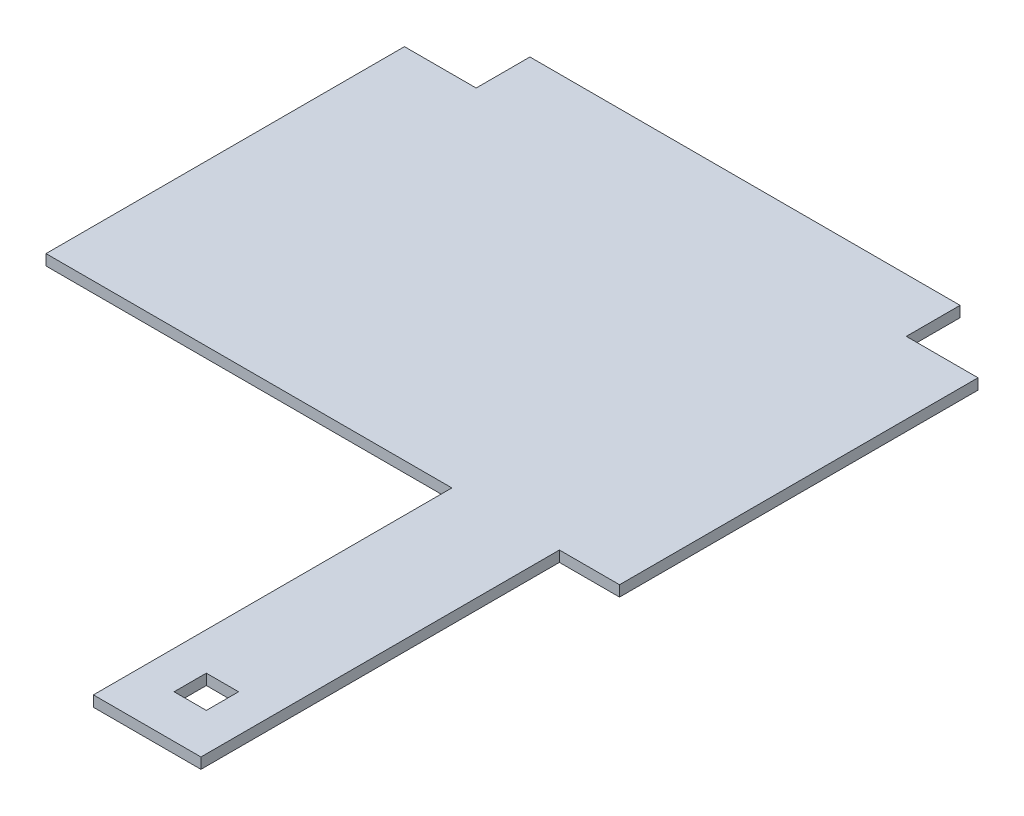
from build123d import *

# Parameters (mm, degrees)
SKETCH1_W           = 9
SKETCH1_H           = 9
BOSS_EXTRUDE1_DEPTH = 3


with BuildPart() as part:
    # Sketch1 → Boss-Extrude1 (new body)
    with BuildSketch(Plane(origin=(0, 0, 0), x_dir=(1, 0, 0), z_dir=(0, 1, 0))):
        Polygon((-80, 50), (-60, 50), (-60, 65), (60, 65), (60, 50), (80, 50), (80, -50), (63.226035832, -50), (63.226035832, -150), (33.226035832, -150), (33.226035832, -50), (-80, -50), align=None)
        with Locations((48.226035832, -133.5)):
            Rectangle(SKETCH1_W, SKETCH1_H, mode=Mode.SUBTRACT)
    extrude(amount=BOSS_EXTRUDE1_DEPTH)


solid = part.part
